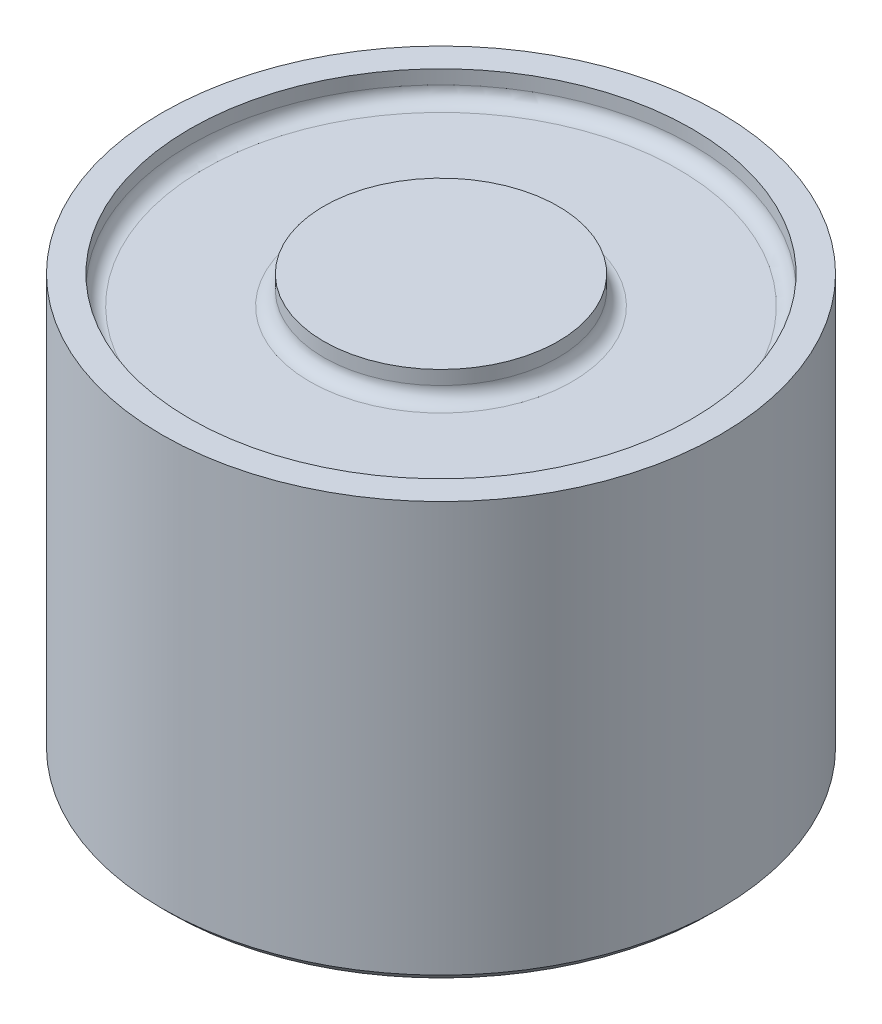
ISO-10303-21;
HEADER;
FILE_DESCRIPTION(('STEP AP214'),'2;1');
FILE_NAME('part.step','',(''),(''),'','','');
FILE_SCHEMA(('AUTOMOTIVE_DESIGN { 1 0 10303 214 1 1 1 1 }'));
ENDSEC;
DATA;
#1=APPLICATION_CONTEXT('core data for automotive mechanical design processes');
#2=APPLICATION_PROTOCOL_DEFINITION('international standard','automotive_design',2000,#1);
#3=PRODUCT_CONTEXT('',#1,'mechanical');
#4=PRODUCT('Part','Part','',(#3));
#5=PRODUCT_RELATED_PRODUCT_CATEGORY('part','',(#4));
#6=PRODUCT_DEFINITION_FORMATION('','',#4);
#7=PRODUCT_DEFINITION_CONTEXT('part definition',#1,'design');
#8=PRODUCT_DEFINITION('design','',#6,#7);
#9=PRODUCT_DEFINITION_SHAPE('','',#8);
#10=(LENGTH_UNIT() NAMED_UNIT(*) SI_UNIT(.MILLI.,.METRE.));
#11=(NAMED_UNIT(*) PLANE_ANGLE_UNIT() SI_UNIT($,.RADIAN.));
#12=(NAMED_UNIT(*) SI_UNIT($,.STERADIAN.) SOLID_ANGLE_UNIT());
#13=UNCERTAINTY_MEASURE_WITH_UNIT(LENGTH_MEASURE(1.E-05),#10,'distance_accuracy_value','');
#14=(GEOMETRIC_REPRESENTATION_CONTEXT(3) GLOBAL_UNCERTAINTY_ASSIGNED_CONTEXT((#13)) GLOBAL_UNIT_ASSIGNED_CONTEXT((#10,
#11,#12)) REPRESENTATION_CONTEXT('',''));
#15=CARTESIAN_POINT('',(0.,0.,0.));
#16=DIRECTION('',(0.,0.,1.));
#17=DIRECTION('',(1.,0.,0.));
#18=AXIS2_PLACEMENT_3D('',#15,#16,#17);
#19=CARTESIAN_POINT('',(0.,15.,0.));
#20=DIRECTION('',(0.,-1.,0.));
#21=DIRECTION('',(0.,0.,-1.));
#22=AXIS2_PLACEMENT_3D('',#19,#20,#21);
#23=CYLINDRICAL_SURFACE('',#22,10.);
#24=CARTESIAN_POINT('',(0.,0.299999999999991,0.));
#25=DIRECTION('',(0.,1.,0.));
#26=DIRECTION('',(0.,0.,1.));
#27=AXIS2_PLACEMENT_3D('',#24,#25,#26);
#28=CIRCLE('',#27,10.);
#29=CARTESIAN_POINT('',(0.,0.299999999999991,10.));
#30=VERTEX_POINT('',#29);
#31=EDGE_CURVE('E21',#30,#30,#28,.T.);
#32=ORIENTED_EDGE('',*,*,#31,.T.);
#33=EDGE_LOOP('',(#32));
#34=FACE_BOUND('',#33,.T.);
#35=CARTESIAN_POINT('',(0.,15.,0.));
#36=DIRECTION('',(0.,1.,0.));
#37=DIRECTION('',(0.,0.,1.));
#38=AXIS2_PLACEMENT_3D('',#35,#36,#37);
#39=CIRCLE('',#38,10.);
#40=CARTESIAN_POINT('',(0.,15.,10.));
#41=VERTEX_POINT('',#40);
#42=EDGE_CURVE('E40',#41,#41,#39,.T.);
#43=ORIENTED_EDGE('',*,*,#42,.F.);
#44=EDGE_LOOP('',(#43));
#45=FACE_BOUND('',#44,.T.);
#46=ADVANCED_FACE('F14',(#34,#45),#23,.T.);
#47=CARTESIAN_POINT('',(0.,15.,0.));
#48=DIRECTION('',(0.,1.,0.));
#49=DIRECTION('',(0.,0.,1.));
#50=AXIS2_PLACEMENT_3D('',#47,#48,#49);
#51=PLANE('',#50);
#52=CARTESIAN_POINT('',(0.,15.,0.));
#53=DIRECTION('',(0.,1.,0.));
#54=DIRECTION('',(0.,0.,1.));
#55=AXIS2_PLACEMENT_3D('',#52,#53,#54);
#56=CIRCLE('',#55,9.);
#57=CARTESIAN_POINT('',(0.,15.,9.));
#58=VERTEX_POINT('',#57);
#59=EDGE_CURVE('E43',#58,#58,#56,.T.);
#60=ORIENTED_EDGE('',*,*,#59,.F.);
#61=EDGE_LOOP('',(#60));
#62=FACE_BOUND('',#61,.T.);
#63=ORIENTED_EDGE('',*,*,#42,.T.);
#64=EDGE_LOOP('',(#63));
#65=FACE_BOUND('',#64,.T.);
#66=ADVANCED_FACE('F81',(#62,#65),#51,.T.);
#67=CARTESIAN_POINT('',(0.,0.,0.));
#68=DIRECTION('',(0.,1.,0.));
#69=DIRECTION('',(0.,0.,1.));
#70=AXIS2_PLACEMENT_3D('',#67,#68,#69);
#71=PLANE('',#70);
#72=CARTESIAN_POINT('',(0.,0.,0.));
#73=DIRECTION('',(0.,1.,0.));
#74=DIRECTION('',(0.,0.,1.));
#75=AXIS2_PLACEMENT_3D('',#72,#73,#74);
#76=CIRCLE('',#75,9.7);
#77=CARTESIAN_POINT('',(0.,0.,9.7));
#78=VERTEX_POINT('',#77);
#79=EDGE_CURVE('E10',#78,#78,#76,.F.);
#80=ORIENTED_EDGE('',*,*,#79,.T.);
#81=EDGE_LOOP('',(#80));
#82=FACE_BOUND('',#81,.T.);
#83=CARTESIAN_POINT('',(4.33012701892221,0.,2.49999999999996));
#84=DIRECTION('',(0.,-1.,0.));
#85=DIRECTION('',(0.,0.,-1.));
#86=AXIS2_PLACEMENT_3D('',#83,#84,#85);
#87=CIRCLE('',#86,1.4);
#88=CARTESIAN_POINT('',(4.33012701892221,0.,1.09999999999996));
#89=VERTEX_POINT('',#88);
#90=EDGE_CURVE('E62',#89,#89,#87,.T.);
#91=ORIENTED_EDGE('',*,*,#90,.F.);
#92=EDGE_LOOP('',(#91));
#93=FACE_BOUND('',#92,.T.);
#94=CARTESIAN_POINT('',(-4.33012701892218,0.,2.50000000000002));
#95=DIRECTION('',(0.,-1.,0.));
#96=DIRECTION('',(0.,0.,-1.));
#97=AXIS2_PLACEMENT_3D('',#94,#95,#96);
#98=CIRCLE('',#97,1.4);
#99=CARTESIAN_POINT('',(-4.33012701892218,0.,1.10000000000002));
#100=VERTEX_POINT('',#99);
#101=EDGE_CURVE('E56',#100,#100,#98,.T.);
#102=ORIENTED_EDGE('',*,*,#101,.F.);
#103=EDGE_LOOP('',(#102));
#104=FACE_BOUND('',#103,.T.);
#105=CARTESIAN_POINT('',(0.,0.,-5.));
#106=DIRECTION('',(0.,-1.,0.));
#107=DIRECTION('',(0.,0.,-1.));
#108=AXIS2_PLACEMENT_3D('',#105,#106,#107);
#109=CIRCLE('',#108,1.4);
#110=CARTESIAN_POINT('',(0.,0.,-6.4));
#111=VERTEX_POINT('',#110);
#112=EDGE_CURVE('E50',#111,#111,#109,.T.);
#113=ORIENTED_EDGE('',*,*,#112,.F.);
#114=EDGE_LOOP('',(#113));
#115=FACE_BOUND('',#114,.T.);
#116=ADVANCED_FACE('F77',(#82,#93,#104,#115),#71,.F.);
#117=CARTESIAN_POINT('',(0.,14.,0.));
#118=DIRECTION('',(0.,1.,0.));
#119=DIRECTION('',(0.,0.,1.));
#120=AXIS2_PLACEMENT_3D('',#117,#118,#119);
#121=CYLINDRICAL_SURFACE('',#120,9.);
#122=CARTESIAN_POINT('',(0.,14.5,0.));
#123=DIRECTION('',(0.,1.,0.));
#124=DIRECTION('',(0.,0.,1.));
#125=AXIS2_PLACEMENT_3D('',#122,#123,#124);
#126=CIRCLE('',#125,9.);
#127=CARTESIAN_POINT('',(0.,14.5,9.));
#128=VERTEX_POINT('',#127);
#129=EDGE_CURVE('E25',#128,#128,#126,.F.);
#130=ORIENTED_EDGE('',*,*,#129,.T.);
#131=EDGE_LOOP('',(#130));
#132=FACE_BOUND('',#131,.T.);
#133=ORIENTED_EDGE('',*,*,#59,.T.);
#134=EDGE_LOOP('',(#133));
#135=FACE_BOUND('',#134,.T.);
#136=ADVANCED_FACE('F80',(#132,#135),#121,.F.);
#137=CARTESIAN_POINT('',(0.,14.,0.));
#138=DIRECTION('',(0.,1.,0.));
#139=DIRECTION('',(0.,0.,1.));
#140=AXIS2_PLACEMENT_3D('',#137,#138,#139);
#141=PLANE('',#140);
#142=CARTESIAN_POINT('',(0.,14.,0.));
#143=DIRECTION('',(0.,1.,0.));
#144=DIRECTION('',(0.,0.,1.));
#145=AXIS2_PLACEMENT_3D('',#142,#143,#144);
#146=CIRCLE('',#145,4.7);
#147=CARTESIAN_POINT('',(0.,14.,4.7));
#148=VERTEX_POINT('',#147);
#149=EDGE_CURVE('E29',#148,#148,#146,.F.);
#150=ORIENTED_EDGE('',*,*,#149,.T.);
#151=EDGE_LOOP('',(#150));
#152=FACE_BOUND('',#151,.T.);
#153=CARTESIAN_POINT('',(0.,14.,0.));
#154=DIRECTION('',(0.,1.,0.));
#155=DIRECTION('',(0.,0.,1.));
#156=AXIS2_PLACEMENT_3D('',#153,#154,#155);
#157=CIRCLE('',#156,8.5);
#158=CARTESIAN_POINT('',(0.,14.,8.5));
#159=VERTEX_POINT('',#158);
#160=EDGE_CURVE('E34',#159,#159,#157,.T.);
#161=ORIENTED_EDGE('',*,*,#160,.T.);
#162=EDGE_LOOP('',(#161));
#163=FACE_BOUND('',#162,.T.);
#164=ADVANCED_FACE('F131',(#152,#163),#141,.T.);
#165=CARTESIAN_POINT('',(0.,14.,0.));
#166=DIRECTION('',(0.,1.,0.));
#167=DIRECTION('',(0.,0.,1.));
#168=AXIS2_PLACEMENT_3D('',#165,#166,#167);
#169=CYLINDRICAL_SURFACE('',#168,4.2);
#170=CARTESIAN_POINT('',(0.,14.5,0.));
#171=DIRECTION('',(0.,1.,0.));
#172=DIRECTION('',(0.,0.,1.));
#173=AXIS2_PLACEMENT_3D('',#170,#171,#172);
#174=CIRCLE('',#173,4.2);
#175=CARTESIAN_POINT('',(0.,14.5,4.2));
#176=VERTEX_POINT('',#175);
#177=EDGE_CURVE('E37',#176,#176,#174,.T.);
#178=ORIENTED_EDGE('',*,*,#177,.T.);
#179=EDGE_LOOP('',(#178));
#180=FACE_BOUND('',#179,.T.);
#181=CARTESIAN_POINT('',(0.,15.,0.));
#182=DIRECTION('',(0.,1.,0.));
#183=DIRECTION('',(0.,0.,1.));
#184=AXIS2_PLACEMENT_3D('',#181,#182,#183);
#185=CIRCLE('',#184,4.2);
#186=CARTESIAN_POINT('',(0.,15.,4.2));
#187=VERTEX_POINT('',#186);
#188=EDGE_CURVE('E46',#187,#187,#185,.T.);
#189=ORIENTED_EDGE('',*,*,#188,.F.);
#190=EDGE_LOOP('',(#189));
#191=FACE_BOUND('',#190,.T.);
#192=ADVANCED_FACE('F123',(#180,#191),#169,.T.);
#193=ORIENTED_EDGE('',*,*,#188,.T.);
#194=EDGE_LOOP('',(#193));
#195=FACE_BOUND('',#194,.T.);
#196=ADVANCED_FACE('F114',(#195),#51,.T.);
#197=CARTESIAN_POINT('',(0.,14.5,0.));
#198=DIRECTION('',(0.,1.,0.));
#199=DIRECTION('',(0.,0.,1.));
#200=AXIS2_PLACEMENT_3D('',#197,#198,#199);
#201=TOROIDAL_SURFACE('',#200,4.7,0.5);
#202=ORIENTED_EDGE('',*,*,#149,.F.);
#203=EDGE_LOOP('',(#202));
#204=FACE_BOUND('',#203,.T.);
#205=ORIENTED_EDGE('',*,*,#177,.F.);
#206=EDGE_LOOP('',(#205));
#207=FACE_BOUND('',#206,.T.);
#208=ADVANCED_FACE('F102',(#204,#207),#201,.F.);
#209=CARTESIAN_POINT('',(0.,14.5,0.));
#210=DIRECTION('',(0.,1.,0.));
#211=DIRECTION('',(0.,0.,1.));
#212=AXIS2_PLACEMENT_3D('',#209,#210,#211);
#213=TOROIDAL_SURFACE('',#212,8.5,0.5);
#214=ORIENTED_EDGE('',*,*,#129,.F.);
#215=EDGE_LOOP('',(#214));
#216=FACE_BOUND('',#215,.T.);
#217=ORIENTED_EDGE('',*,*,#160,.F.);
#218=EDGE_LOOP('',(#217));
#219=FACE_BOUND('',#218,.T.);
#220=ADVANCED_FACE('F90',(#216,#219),#213,.F.);
#221=CARTESIAN_POINT('',(0.,4.,-5.));
#222=DIRECTION('',(0.,-1.,0.));
#223=DIRECTION('',(0.,0.,-1.));
#224=AXIS2_PLACEMENT_3D('',#221,#222,#223);
#225=CYLINDRICAL_SURFACE('',#224,1.4);
#226=CARTESIAN_POINT('',(0.,4.,-5.));
#227=DIRECTION('',(0.,-1.,0.));
#228=DIRECTION('',(0.,0.,-1.));
#229=AXIS2_PLACEMENT_3D('',#226,#227,#228);
#230=CIRCLE('',#229,1.4);
#231=CARTESIAN_POINT('',(0.,4.,-6.4));
#232=VERTEX_POINT('',#231);
#233=EDGE_CURVE('E49',#232,#232,#230,.T.);
#234=ORIENTED_EDGE('',*,*,#233,.F.);
#235=EDGE_LOOP('',(#234));
#236=FACE_BOUND('',#235,.T.);
#237=ORIENTED_EDGE('',*,*,#112,.T.);
#238=EDGE_LOOP('',(#237));
#239=FACE_BOUND('',#238,.T.);
#240=ADVANCED_FACE('F87',(#236,#239),#225,.F.);
#241=CARTESIAN_POINT('',(0.,4.,-5.));
#242=DIRECTION('',(0.,-1.,0.));
#243=DIRECTION('',(0.,0.,-1.));
#244=AXIS2_PLACEMENT_3D('',#241,#242,#243);
#245=PLANE('',#244);
#246=ORIENTED_EDGE('',*,*,#233,.T.);
#247=EDGE_LOOP('',(#246));
#248=FACE_BOUND('',#247,.T.);
#249=ADVANCED_FACE('F89',(#248),#245,.T.);
#250=CARTESIAN_POINT('',(-4.33012701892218,4.,2.50000000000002));
#251=DIRECTION('',(0.,-1.,0.));
#252=DIRECTION('',(0.,0.,-1.));
#253=AXIS2_PLACEMENT_3D('',#250,#251,#252);
#254=CYLINDRICAL_SURFACE('',#253,1.4);
#255=CARTESIAN_POINT('',(-4.33012701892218,4.,2.50000000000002));
#256=DIRECTION('',(0.,-1.,0.));
#257=DIRECTION('',(0.,0.,-1.));
#258=AXIS2_PLACEMENT_3D('',#255,#256,#257);
#259=CIRCLE('',#258,1.4);
#260=CARTESIAN_POINT('',(-4.33012701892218,4.,1.10000000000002));
#261=VERTEX_POINT('',#260);
#262=EDGE_CURVE('E53',#261,#261,#259,.T.);
#263=ORIENTED_EDGE('',*,*,#262,.F.);
#264=EDGE_LOOP('',(#263));
#265=FACE_BOUND('',#264,.T.);
#266=ORIENTED_EDGE('',*,*,#101,.T.);
#267=EDGE_LOOP('',(#266));
#268=FACE_BOUND('',#267,.T.);
#269=ADVANCED_FACE('F99',(#265,#268),#254,.F.);
#270=CARTESIAN_POINT('',(-4.33012701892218,4.,2.50000000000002));
#271=DIRECTION('',(0.,-1.,0.));
#272=DIRECTION('',(0.,0.,-1.));
#273=AXIS2_PLACEMENT_3D('',#270,#271,#272);
#274=PLANE('',#273);
#275=ORIENTED_EDGE('',*,*,#262,.T.);
#276=EDGE_LOOP('',(#275));
#277=FACE_BOUND('',#276,.T.);
#278=ADVANCED_FACE('F73',(#277),#274,.T.);
#279=CARTESIAN_POINT('',(4.33012701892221,4.,2.49999999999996));
#280=DIRECTION('',(0.,-1.,0.));
#281=DIRECTION('',(0.,0.,-1.));
#282=AXIS2_PLACEMENT_3D('',#279,#280,#281);
#283=CYLINDRICAL_SURFACE('',#282,1.4);
#284=CARTESIAN_POINT('',(4.33012701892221,4.,2.49999999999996));
#285=DIRECTION('',(0.,-1.,0.));
#286=DIRECTION('',(0.,0.,-1.));
#287=AXIS2_PLACEMENT_3D('',#284,#285,#286);
#288=CIRCLE('',#287,1.4);
#289=CARTESIAN_POINT('',(4.33012701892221,4.,1.09999999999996));
#290=VERTEX_POINT('',#289);
#291=EDGE_CURVE('E59',#290,#290,#288,.T.);
#292=ORIENTED_EDGE('',*,*,#291,.F.);
#293=EDGE_LOOP('',(#292));
#294=FACE_BOUND('',#293,.T.);
#295=ORIENTED_EDGE('',*,*,#90,.T.);
#296=EDGE_LOOP('',(#295));
#297=FACE_BOUND('',#296,.T.);
#298=ADVANCED_FACE('F70',(#294,#297),#283,.F.);
#299=CARTESIAN_POINT('',(4.33012701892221,4.,2.49999999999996));
#300=DIRECTION('',(0.,-1.,0.));
#301=DIRECTION('',(0.,0.,-1.));
#302=AXIS2_PLACEMENT_3D('',#299,#300,#301);
#303=PLANE('',#302);
#304=ORIENTED_EDGE('',*,*,#291,.T.);
#305=EDGE_LOOP('',(#304));
#306=FACE_BOUND('',#305,.T.);
#307=ADVANCED_FACE('F68',(#306),#303,.T.);
#308=CARTESIAN_POINT('',(0.,0.299999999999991,0.));
#309=DIRECTION('',(0.,1.,0.));
#310=DIRECTION('',(0.,0.,1.));
#311=AXIS2_PLACEMENT_3D('',#308,#309,#310);
#312=CONICAL_SURFACE('',#311,10.,0.785398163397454);
#313=ORIENTED_EDGE('',*,*,#79,.F.);
#314=EDGE_LOOP('',(#313));
#315=FACE_BOUND('',#314,.T.);
#316=ORIENTED_EDGE('',*,*,#31,.F.);
#317=EDGE_LOOP('',(#316));
#318=FACE_BOUND('',#317,.T.);
#319=ADVANCED_FACE('F16',(#315,#318),#312,.T.);
#320=CLOSED_SHELL('',(#46,#66,#116,#136,#164,#192,#196,#208,#220,#240,#249,#269,#278,#298,#307,#319));
#321=MANIFOLD_SOLID_BREP('B1',#320);
#322=ADVANCED_BREP_SHAPE_REPRESENTATION('',(#18,#321),#14);
#323=SHAPE_DEFINITION_REPRESENTATION(#9,#322);
ENDSEC;
END-ISO-10303-21;
